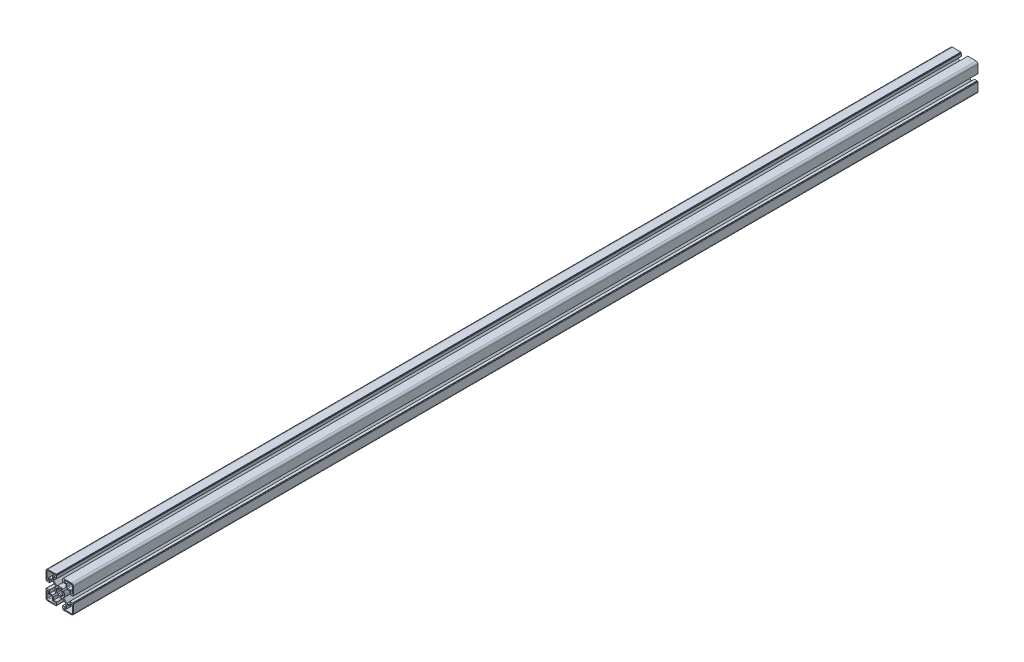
from build123d import *

# Parameters (mm, degrees)
BOSS_EXTRUDE1_DEPTH = 1485.7984


with BuildPart() as part:
    # Sketch1 → Boss-Extrude1 (new body)
    with BuildSketch(Plane.XY):
        with BuildLine():
            Line((-19.5072, 22.5044), (-5.7912, 22.5044))
            Line((-5.7912, 22.5044), (-5.7912, 21.0058))
            Line((-5.7912, 21.0058), (-5.0038, 21.0058))
            Line((-5.0038, 21.0058), (-5.0038, 16.51))
            Line((-5.0038, 16.51), (-10.0457, 16.51))
            Line((-10.0457, 16.51), (-10.0457, 11.680106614))
            Line((-10.0457, 11.680106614), (-4.781026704, 6.415433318))
            ThreePointArc((-4.781026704, 6.415433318), (0, 8.001), (4.781026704, 6.415433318))
            Line((4.781026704, 6.415433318), (10.0457, 11.680106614))
            Line((10.0457, 11.680106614), (10.0457, 16.51))
            Line((10.0457, 16.51), (5.0038, 16.51))
            Line((5.0038, 16.51), (5.0038, 21.0058))
            Line((5.0038, 21.0058), (5.7912, 21.0058))
            Line((5.7912, 21.0058), (5.7912, 22.5044))
            Line((5.7912, 22.5044), (19.5072, 22.5044))
            ThreePointArc((19.5072, 22.5044), (21.626540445, 21.626540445), (22.5044, 19.5072))
            Line((22.5044, 19.5072), (22.5044, 5.7912))
            Line((22.5044, 5.7912), (21.0058, 5.7912))
            Line((21.0058, 5.7912), (21.0058, 5.0038))
            Line((21.0058, 5.0038), (16.51, 5.0038))
            Line((16.51, 5.0038), (16.51, 10.0457))
            Line((16.51, 10.0457), (11.680106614, 10.0457))
            Line((11.680106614, 10.0457), (6.415433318, 4.781026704))
            ThreePointArc((6.415433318, 4.781026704), (8.001, 0), (6.415433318, -4.781026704))
            Line((6.415433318, -4.781026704), (11.680106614, -10.0457))
            Line((11.680106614, -10.0457), (16.51, -10.0457))
            Line((16.51, -10.0457), (16.51, -5.0038))
            Line((16.51, -5.0038), (21.0058, -5.0038))
            Line((21.0058, -5.0038), (21.0058, -5.7912))
            Line((21.0058, -5.7912), (22.5044, -5.7912))
            Line((22.5044, -5.7912), (22.5044, -19.5072))
            ThreePointArc((22.5044, -19.5072), (21.626540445, -21.626540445), (19.5072, -22.5044))
            Line((19.5072, -22.5044), (5.7912, -22.5044))
            Line((5.7912, -22.5044), (5.7912, -21.0058))
            Line((5.7912, -21.0058), (5.0038, -21.0058))
            Line((5.0038, -21.0058), (5.0038, -16.51))
            Line((5.0038, -16.51), (10.0457, -16.51))
            Line((10.0457, -16.51), (10.0457, -11.680106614))
            Line((10.0457, -11.680106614), (4.781026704, -6.415433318))
            ThreePointArc((4.781026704, -6.415433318), (0, -8.001), (-4.781026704, -6.415433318))
            Line((-4.781026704, -6.415433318), (-10.0457, -11.680106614))
            Line((-10.0457, -11.680106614), (-10.0457, -16.51))
            Line((-10.0457, -16.51), (-5.0038, -16.51))
            Line((-5.0038, -16.51), (-5.0038, -21.0058))
            Line((-5.0038, -21.0058), (-5.7912, -21.0058))
            Line((-5.7912, -21.0058), (-5.7912, -22.5044))
            Line((-5.7912, -22.5044), (-19.5072, -22.5044))
            ThreePointArc((-19.5072, -22.5044), (-21.626540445, -21.626540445), (-22.5044, -19.5072))
            Line((-22.5044, -19.5072), (-22.5044, -5.7912))
            Line((-22.5044, -5.7912), (-21.0058, -5.7912))
            Line((-21.0058, -5.7912), (-21.0058, -5.0038))
            Line((-21.0058, -5.0038), (-16.51, -5.0038))
            Line((-16.51, -5.0038), (-16.51, -10.0457))
            Line((-16.51, -10.0457), (-11.680106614, -10.0457))
            Line((-11.680106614, -10.0457), (-6.415433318, -4.781026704))
            ThreePointArc((-6.415433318, -4.781026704), (-8.001, 0), (-6.415433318, 4.781026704))
            Line((-6.415433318, 4.781026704), (-11.680106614, 10.0457))
            Line((-11.680106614, 10.0457), (-16.51, 10.0457))
            Line((-16.51, 10.0457), (-16.51, 5.0038))
            Line((-16.51, 5.0038), (-21.0058, 5.0038))
            Line((-21.0058, 5.0038), (-21.0058, 5.7912))
            Line((-21.0058, 5.7912), (-22.5044, 5.7912))
            Line((-22.5044, 5.7912), (-22.5044, 19.5072))
            ThreePointArc((-22.5044, 19.5072), (-21.626540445, 21.626540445), (-19.5072, 22.5044))
        make_face()
        with BuildLine():
            Line((-18.0086, 11.5443), (-13.0429, 11.5443))
            ThreePointArc((-13.0429, 11.5443), (-11.983229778, 11.983229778), (-11.5443, 13.0429))
            Line((-11.5443, 13.0429), (-11.5443, 18.0086))
            Line((-11.5443, 18.0086), (-8.7884, 18.0086))
            ThreePointArc((-8.7884, 18.0086), (-7.2898, 19.5072), (-8.7884, 21.0058))
            Line((-8.7884, 21.0058), (-19.5072, 21.0058))
            ThreePointArc((-19.5072, 21.0058), (-20.566870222, 20.566870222), (-21.0058, 19.5072))
            Line((-21.0058, 19.5072), (-21.0058, 8.7884))
            ThreePointArc((-21.0058, 8.7884), (-19.5072, 7.2898), (-18.0086, 8.7884))
            Line((-18.0086, 8.7884), (-18.0086, 11.5443))
        make_face(mode=Mode.SUBTRACT)
        with BuildLine():
            Line((1.189270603, 5.978867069), (0.976192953, 4.907653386))
            ThreePointArc((0.976192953, 4.907653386), (0, 5.0038), (-0.976192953, 4.907653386))
            Line((-0.976192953, 4.907653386), (-1.189270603, 5.978867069))
            ThreePointArc((-1.189270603, 5.978867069), (-2.332838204, 5.63196963), (-3.38675614, 5.068638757))
            Line((-3.38675614, 5.068638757), (-2.779962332, 4.160507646))
            ThreePointArc((-2.779962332, 4.160507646), (-3.538220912, 3.538220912), (-4.160507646, 2.779962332))
            Line((-4.160507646, 2.779962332), (-5.068638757, 3.38675614))
            ThreePointArc((-5.068638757, 3.38675614), (-5.63196963, 2.332838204), (-5.978867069, 1.189270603))
            Line((-5.978867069, 1.189270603), (-4.907653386, 0.976192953))
            ThreePointArc((-4.907653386, 0.976192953), (-5.0038, 0), (-4.907653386, -0.976192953))
            Line((-4.907653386, -0.976192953), (-5.978867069, -1.189270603))
            ThreePointArc((-5.978867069, -1.189270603), (-5.63196963, -2.332838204), (-5.068638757, -3.38675614))
            Line((-5.068638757, -3.38675614), (-4.160507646, -2.779962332))
            ThreePointArc((-4.160507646, -2.779962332), (-3.538220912, -3.538220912), (-2.779962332, -4.160507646))
            Line((-2.779962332, -4.160507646), (-3.38675614, -5.068638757))
            ThreePointArc((-3.38675614, -5.068638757), (-2.332838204, -5.63196963), (-1.189270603, -5.978867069))
            Line((-1.189270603, -5.978867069), (-0.976192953, -4.907653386))
            ThreePointArc((-0.976192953, -4.907653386), (0, -5.0038), (0.976192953, -4.907653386))
            Line((0.976192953, -4.907653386), (1.189270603, -5.978867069))
            ThreePointArc((1.189270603, -5.978867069), (2.332838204, -5.63196963), (3.38675614, -5.068638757))
            Line((3.38675614, -5.068638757), (2.779962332, -4.160507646))
            ThreePointArc((2.779962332, -4.160507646), (3.538220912, -3.538220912), (4.160507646, -2.779962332))
            Line((4.160507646, -2.779962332), (5.068638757, -3.38675614))
            ThreePointArc((5.068638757, -3.38675614), (5.63196963, -2.332838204), (5.978867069, -1.189270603))
            Line((5.978867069, -1.189270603), (4.907653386, -0.976192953))
            ThreePointArc((4.907653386, -0.976192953), (5.0038, 0), (4.907653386, 0.976192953))
            Line((4.907653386, 0.976192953), (5.978867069, 1.189270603))
            ThreePointArc((5.978867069, 1.189270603), (5.63196963, 2.332838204), (5.068638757, 3.38675614))
            Line((5.068638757, 3.38675614), (4.160507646, 2.779962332))
            ThreePointArc((4.160507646, 2.779962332), (3.538220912, 3.538220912), (2.779962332, 4.160507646))
            Line((2.779962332, 4.160507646), (3.38675614, 5.068638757))
            ThreePointArc((3.38675614, 5.068638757), (2.332838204, 5.63196963), (1.189270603, 5.978867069))
        make_face(mode=Mode.SUBTRACT)
        with BuildLine():
            Line((11.5443, 18.0086), (8.7884, 18.0086))
            ThreePointArc((8.7884, 18.0086), (7.2898, 19.5072), (8.7884, 21.0058))
            Line((8.7884, 21.0058), (19.5072, 21.0058))
            ThreePointArc((19.5072, 21.0058), (20.566870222, 20.566870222), (21.0058, 19.5072))
            Line((21.0058, 19.5072), (21.0058, 8.7884))
            ThreePointArc((21.0058, 8.7884), (19.5072, 7.2898), (18.0086, 8.7884))
            Line((18.0086, 8.7884), (18.0086, 11.5443))
            Line((18.0086, 11.5443), (13.0429, 11.5443))
            ThreePointArc((13.0429, 11.5443), (11.983229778, 11.983229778), (11.5443, 13.0429))
            Line((11.5443, 13.0429), (11.5443, 18.0086))
        make_face(mode=Mode.SUBTRACT)
        with BuildLine():
            Line((18.0086, -11.5443), (13.0429, -11.5443))
            ThreePointArc((13.0429, -11.5443), (11.983229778, -11.983229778), (11.5443, -13.0429))
            Line((11.5443, -13.0429), (11.5443, -18.0086))
            Line((11.5443, -18.0086), (8.7884, -18.0086))
            ThreePointArc((8.7884, -18.0086), (7.2898, -19.5072), (8.7884, -21.0058))
            Line((8.7884, -21.0058), (19.5072, -21.0058))
            ThreePointArc((19.5072, -21.0058), (20.566870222, -20.566870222), (21.0058, -19.5072))
            Line((21.0058, -19.5072), (21.0058, -8.7884))
            ThreePointArc((21.0058, -8.7884), (19.5072, -7.2898), (18.0086, -8.7884))
            Line((18.0086, -8.7884), (18.0086, -11.5443))
        make_face(mode=Mode.SUBTRACT)
        with BuildLine():
            Line((-11.5443, -18.0086), (-8.7884, -18.0086))
            ThreePointArc((-8.7884, -18.0086), (-7.2898, -19.5072), (-8.7884, -21.0058))
            Line((-8.7884, -21.0058), (-19.5072, -21.0058))
            ThreePointArc((-19.5072, -21.0058), (-20.566870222, -20.566870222), (-21.0058, -19.5072))
            Line((-21.0058, -19.5072), (-21.0058, -8.7884))
            ThreePointArc((-21.0058, -8.7884), (-19.5072, -7.2898), (-18.0086, -8.7884))
            Line((-18.0086, -8.7884), (-18.0086, -11.5443))
            Line((-18.0086, -11.5443), (-13.0429, -11.5443))
            ThreePointArc((-13.0429, -11.5443), (-11.983229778, -11.983229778), (-11.5443, -13.0429))
            Line((-11.5443, -13.0429), (-11.5443, -18.0086))
        make_face(mode=Mode.SUBTRACT)
    extrude(amount=BOSS_EXTRUDE1_DEPTH)


solid = part.part
